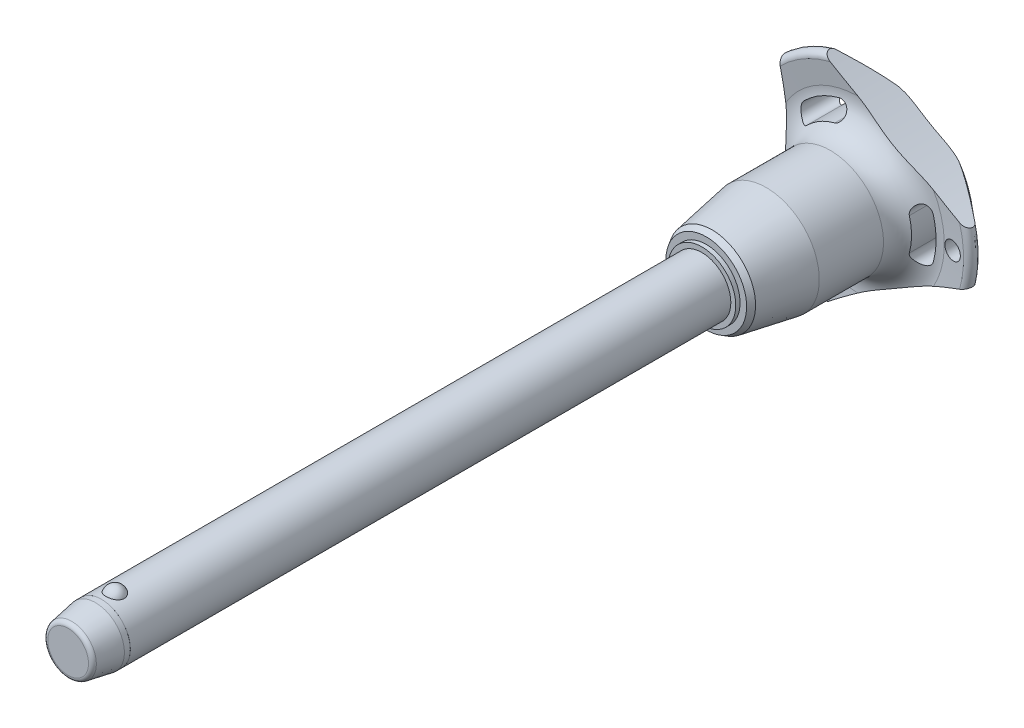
from build123d import *

# Parameters (mm, degrees)
SKETCH1_R           = 5
BOSS_EXTRUDE1_DEPTH = 100
SKETCH2_R           = 4.25
BOSS_EXTRUDE2_DEPTH = 33.3
BOSS_EXTRUDE3_START = 9.6
SKETCH1_2_R         = 5
BOSS_EXTRUDE3_DEPTH = 9.6
CHAMFER1_SIZE       = 4.8
CHAMFER1_SIZE2      = 0.846369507
FILLET1_R           = 0.75
SKETCH6_R           = 102.8
CUT_EXTRUDE1_DEPTH  = 137.15495075
CIRPATTERN1_COUNT   = 3
SKETCH7_R           = 1.5
CUT_EXTRUDE2_DEPTH  = 137.036109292
SKETCH8_R           = 5
SKETCH8_R_2         = 4.99
CUT_EXTRUDE3_DEPTH  = 5.76


with BuildPart() as part:
    # Sketch1 → Boss-Extrude1 (new body)
    with BuildSketch(Plane.XY):
        Circle(SKETCH1_R)
    extrude(amount=-BOSS_EXTRUDE1_DEPTH)

    # Sketch2 → Boss-Extrude2 (add)
    with BuildSketch(Plane(origin=(0, 0, -100), x_dir=(-1, 0, 0), z_dir=(0, 0, -1))):
        Circle(SKETCH2_R)
    extrude(amount=BOSS_EXTRUDE2_DEPTH)

    # Sketch3 → Revolve1 (revolve)
    with BuildSketch(Plane(origin=(0, 0, 0), x_dir=(0, 0, -1), z_dir=(1, 0, 0))):
        with BuildLine():
            Line((-1.516575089, 6), (-1.516575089, 2.7))
            ThreePointArc((-1.516575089, 2.7), (0.133424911, 4.35), (-1.516575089, 6))
        make_face()
        with BuildLine():
            Line((-1.516575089, -2.7), (-1.516575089, -6))
            ThreePointArc((-1.516575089, -6), (0.133424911, -4.35), (-1.516575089, -2.7))
        make_face()
    revolve(axis=Axis((0, -2.7, 1.516575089), (0, 1, 0)))

    # Sketch1_2 → Boss-Extrude3 (add)
    with BuildSketch(Plane.XY.offset(BOSS_EXTRUDE3_START)):
        Circle(SKETCH1_2_R)
    extrude(amount=-BOSS_EXTRUDE3_DEPTH)

    # Chamfer1
    chamfer1_edges = [part.edges().sort_by_distance(p)[0] for p in [
        (-5, 0, 9.6),
    ]]
    chamfer1_side = [part.faces().sort_by_distance(p)[0] for p in [
        (-5, 0, -45.2),
    ]]
    chamfer(chamfer1_edges, length=CHAMFER1_SIZE, length2=CHAMFER1_SIZE2, reference=chamfer1_side[0])

    # Fillet1
    fillet1_edges = [part.edges().sort_by_distance(p)[0] for p in [
        (-4.153630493, 0, 9.6),
        (4.25, 0, -133.3),
    ]]
    fillet(fillet1_edges, radius=FILLET1_R)

    # Sketch4 → Revolve2 (revolve)
    with BuildSketch(Plane(origin=(0, 0, 0), x_dir=(0, 0, -1), z_dir=(1, 0, 0)), mode=Mode.PRIVATE) as revolve2_sk:
        Polygon((100, 0), (100, 5.848880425), (100.75, 5.848880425), (100.75, 6.981619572), (101.730980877, 7.547989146), (111.1, 9.2), (122.2, 9.2), (122.2, 0), align=None)
    revolve(revolve2_sk.sketch.rotate(Axis((0, 0, -122.2), (0, 0, 1)), 90), axis=Axis((0, 0, -122.2), (0, 0, 1)))

    # Sketch5 → Revolve3 (revolve)
    with BuildSketch(Plane(origin=(0, 0, 0), x_dir=(0, 0, -1), z_dir=(1, 0, 0)), mode=Mode.PRIVATE) as revolve3_sk:
        with BuildLine():
            Line((127.169704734, 14.749576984), (126.756059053, 18.490084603))
            ThreePointArc((126.756059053, 18.490084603), (127.35677658, 19.519442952), (128.516044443, 19.24278761))
            Line((128.516044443, 19.24278761), (132.835691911, 14.094832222))
            ThreePointArc((132.835691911, 14.094832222), (133.3, 12.689260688), (132.67067517, 11.349423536))
            ThreePointArc((132.67067517, 11.349423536), (129.033110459, 6.185112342), (127.75, 0))
            Line((127.75, 0), (122.2, 0))
            Line((122.2, 0), (122.2, 9.2))
            ThreePointArc((122.2, 9.2), (125.924774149, 10.864425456), (127.169704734, 14.749576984))
        make_face()
    revolve(revolve3_sk.sketch.rotate(Axis((0, 0, -127.75), (0, 0, 1)), 90), axis=Axis((0, 0, -127.75), (0, 0, 1)))

    # Sketch6 → Cut-Extrude1 (cut, through all)
    with BuildSketch(Plane.XY):
        with Locations((-115.2, 0)):
            Circle(SKETCH6_R)
        with BuildLine():
            ThreePointArc((12.885043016, -3.538869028), (13.362182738, 0), (12.885043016, 3.538869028))
            ThreePointArc((12.885043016, 3.538869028), (11.179749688, 4.509281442), (10.209337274, 2.803988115))
            ThreePointArc((10.209337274, 2.803988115), (10.587394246, 0), (10.209337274, -2.803988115))
            ThreePointArc((10.209337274, -2.803988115), (11.179749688, -4.509281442), (12.885043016, -3.538869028))
        make_face()
    cut_extrude1 = extrude(amount=-CUT_EXTRUDE1_DEPTH, mode=Mode.SUBTRACT)

    # CirPattern1: Cut-Extrude1 ×3 about axis
    cirpattern1_axis = Axis((0, 0, 0), (0, 0, 1))
    for i in range(1, CIRPATTERN1_COUNT):
        add(cut_extrude1.rotate(cirpattern1_axis, i * 360 / CIRPATTERN1_COUNT), mode=Mode.SUBTRACT)

    # Sketch7 → Cut-Extrude2 (cut, through all)
    with BuildSketch(Plane.XY):
        with Locations(Location((16.362182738, 0, 0), (0, 0, 225.449470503))):
            Circle(SKETCH7_R)
    extrude(amount=-CUT_EXTRUDE2_DEPTH, mode=Mode.SUBTRACT)

    # Sketch8 → Cut-Extrude3 (cut)
    with BuildSketch(Plane.XY.offset(9.6)):
        Circle(SKETCH8_R)
        Circle(SKETCH8_R_2, mode=Mode.SUBTRACT)
    extrude(amount=-CUT_EXTRUDE3_DEPTH, mode=Mode.SUBTRACT)


solid = part.part
